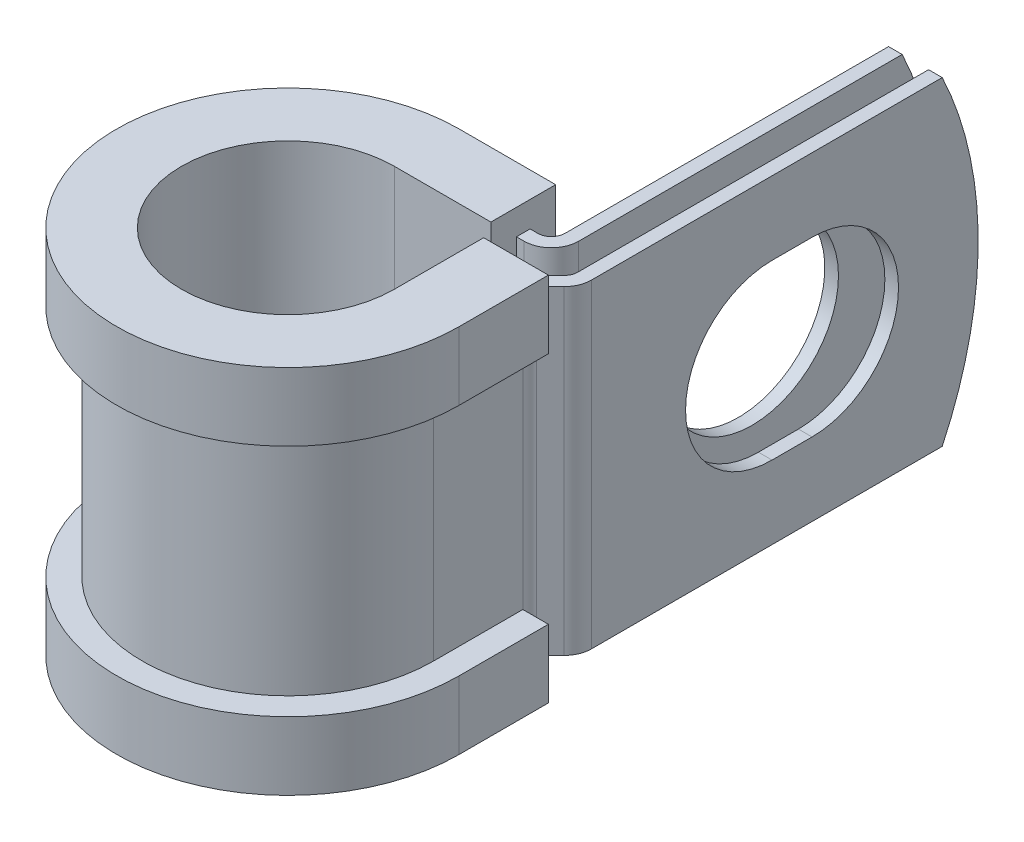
from build123d import *

# Parameters (mm, degrees)
EXTRUDE_THIN1_DEPTH = 9.525
SKETCH2_R           = 5.1562
CUT_EXTRUDE1_DEPTH  = 0.8128
CUT_EXTRUDE2_DEPTH  = 0.8128
CUT_EXTRUDE3_DEPTH  = 36.982667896


with BuildPart() as part:
    # Sketch1 → Extrude-Thin1 (new, symmetric)
    with BuildSketch(Plane(origin=(0, 0, 0), x_dir=(1, 0, 0), z_dir=(0, 1, 0))):
        with BuildLine():
            Line((9.414374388, 30.9372), (9.414374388, 7.874))
            ThreePointArc((9.414374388, 7.874), (9.352503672, 7.562954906), (9.17631078, 7.299263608))
            Line((9.17631078, 7.299263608), (8.350127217, 6.473080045))
            ThreePointArc((8.350127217, 6.473080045), (7.997741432, 5.945697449), (7.874, 5.323607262))
            Line((7.874, 5.323607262), (7.874, 0))
            ThreePointArc((7.874, 0), (-5.567758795, -5.567758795), (0, 7.874))
            Line((0, 7.874), (6.213974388, 7.874))
            ThreePointArc((6.213974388, 7.874), (7.363447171, 8.350127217), (7.839574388, 9.4996))
            Line((7.839574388, 9.4996), (7.839574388, 30.9372))
            Line((7.839574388, 30.9372), (7.026774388, 30.9372))
            Line((7.026774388, 30.9372), (7.026774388, 9.4996))
            ThreePointArc((7.026774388, 9.4996), (6.78871078, 8.924863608), (6.213974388, 8.6868))
            Line((6.213974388, 8.6868), (0, 8.6868))
            ThreePointArc((0, 8.6868), (-6.142495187, -6.142495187), (8.6868, 0))
            Line((8.6868, 0), (8.6868, 5.323607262))
            ThreePointArc((8.6868, 5.323607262), (8.748670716, 5.634652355), (8.924863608, 5.898343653))
            Line((8.924863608, 5.898343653), (9.751047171, 6.724527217))
            ThreePointArc((9.751047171, 6.724527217), (10.103432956, 7.251909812), (10.227174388, 7.874))
            Line((10.227174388, 7.874), (10.227174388, 30.9372))
            Line((10.227174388, 30.9372), (9.414374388, 30.9372))
        make_face()
    extrude(amount=EXTRUDE_THIN1_DEPTH, both=True)

    # Sketch2 → Cut-Extrude1 (cut)
    with BuildSketch(Plane.ZY.offset(-7.026774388)):
        with Locations((-19.8374, 0)):
            Circle(SKETCH2_R)
    extrude(amount=-CUT_EXTRUDE1_DEPTH, mode=Mode.SUBTRACT)

    # Sketch3 → Cut-Extrude2 (cut)
    with BuildSketch(Plane(origin=(10.227174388, 0, 0), x_dir=(0, 0, -1), z_dir=(1, 0, 0))):
        with BuildLine():
            Line((18.6436, 5.1562), (21.0312, 5.1562))
            ThreePointArc((21.0312, 5.1562), (26.1874, 0), (21.0312, -5.1562))
            Line((21.0312, -5.1562), (18.6436, -5.1562))
            ThreePointArc((18.6436, -5.1562), (13.4874, 0), (18.6436, 5.1562))
        make_face()
    extrude(amount=-CUT_EXTRUDE2_DEPTH, mode=Mode.SUBTRACT)

    # Sketch4 → Cut-Extrude3 (cut, through all)
    with BuildSketch(Plane.ZY.offset(-7.026774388)):
        with BuildLine():
            Line((-28.792663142, 9.525), (-30.9372, 9.525))
            Line((-30.9372, 9.525), (-30.9372, -6.4e-08))
            ThreePointArc((-30.9372, -6.4e-08), (-30.394438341, 4.881717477), (-28.792663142, 9.525))
        make_face()
        with BuildLine():
            ThreePointArc((-28.792663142, -9.525), (-30.394438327, -4.88171754), (-30.9372, -6.4e-08))
            Line((-30.9372, -6.4e-08), (-30.9372, -9.525))
            Line((-30.9372, -9.525), (-28.792663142, -9.525))
        make_face()
    extrude(amount=-CUT_EXTRUDE3_DEPTH, mode=Mode.SUBTRACT)

    # Sweep1: sweep along a path in Sketch6
    with BuildLine(Plane(origin=(0, 9.525, 0), x_dir=(1, 0, 0), z_dir=(0, 1, 0))) as sweep1_path:
        Line((6.35, 5.323607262), (6.35, 0))
        ThreePointArc((6.35, 0), (-4.490128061, -4.490128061), (0, 6.35))
        Line((0, 6.35), (5.756774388, 6.35))
    # Sketch5 → Sweep1 (sweep)
    with BuildSketch(Plane(origin=(0, 0, -5.323607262), x_dir=(-1, 0, 0), z_dir=(0, 0, -1))):
        Polygon((-8.6868, 9.525), (-7.874, 9.525), (-7.874, -9.525), (-8.6868, -9.525), (-8.6868, -6.985), (-10.2108, -6.985), (-10.2108, -11.049), (-6.35, -11.049), (-6.35, 11.049), (-10.2108, 11.049), (-10.2108, 6.985), (-8.6868, 6.985), align=None)
    sweep(path=sweep1_path.line)


solid = part.part
